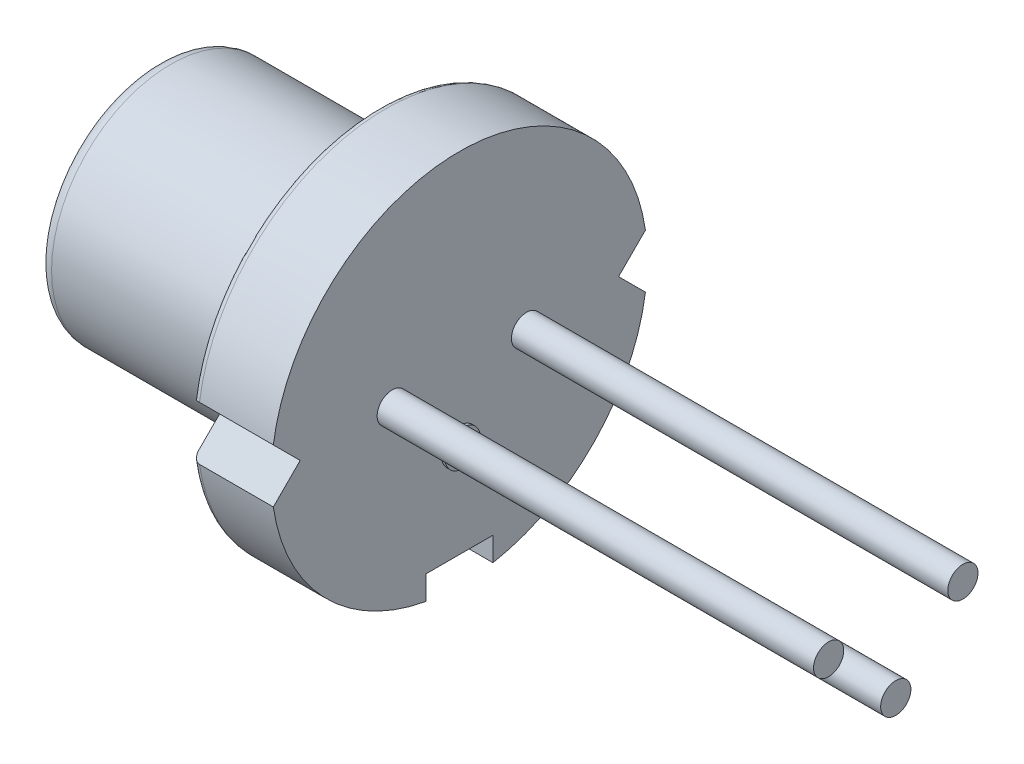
from build123d import *

# Parameters (mm, degrees)
SKETCH6_R           = 0.225
EXTRUDE2_DEPTH      = 6.5
CUT_EXTRUDE1_DEPTH  = 8.611175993
BOSS_EXTRUDE1_START = 0.25
SKETCH10_R          = 0.8
BOSS_EXTRUDE1_DEPTH = 0.25
FILLET1_R           = 0.2
FILLET2_R           = 0.1
SKETCH6_3_R         = 0.265
SKETCH6_3_R_2       = 0.225
BOSS_EXTRUDE2_DEPTH = 0.05


with BuildPart() as part:
    # Sketch4 → Revolve2 (revolve)
    with BuildSketch(Plane.XY, mode=Mode.PRIVATE) as revolve2_sk:
        with BuildLine():
            Line((0, 0), (0, 0.7))
            Line((0, 0.7), (-0.73, 0.7))
            Line((-0.73, 0.7), (-0.73, 0.8))
            Line((-0.73, 0.8), (-1.03, 0.8))
            Line((-1.03, 0.8), (-1.03, 1.775))
            Line((-1.03, 1.775), (1.72, 1.775))
            ThreePointArc((1.72, 1.775), (1.896776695, 1.848223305), (1.97, 2.025))
            Line((1.97, 2.025), (1.97, 2.05))
            Line((1.97, 2.05), (2.27, 2.05))
            Line((2.27, 2.05), (2.27, 2.8))
            Line((2.27, 2.8), (3.47, 2.8))
            Line((3.47, 2.8), (3.47, 0))
            Line((3.47, 0), (0, 0))
        make_face()
    revolve(revolve2_sk.sketch.rotate(Axis((-2.49171246, 0, 0), (1, 0, 0)), 90), axis=Axis((-2.49171246, 0, 0), (1, 0, 0)))

    # Sketch6 → Extrude2 (add)
    with BuildSketch(Plane(origin=(3.47, 0, 0), x_dir=(0, 0, -1), z_dir=(1, 0, 0))):
        with Locations(Location((0, -1, 0), (0, 0, 180))):
            Circle(SKETCH6_R)
        with Locations(Location((-1, 0, 0), (0, 0, 180))):
            Circle(SKETCH6_R)
        with Locations(Location((1, 0, 0), (0, 0, 180))):
            Circle(SKETCH6_R)
    extrude(amount=EXTRUDE2_DEPTH)

    # Sketch8 → Cut-Extrude1 (cut, through all)
    with BuildSketch(Plane(origin=(3.47, 0, 0), x_dir=(0, 0, -1), z_dir=(1, 0, 0))):
        with BuildLine():
            Line((-2.371281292, 0), (-2.771281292, 0.4))
            ThreePointArc((-2.771281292, 0.4), (-2.8, 0), (-2.771281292, -0.4))
            Line((-2.771281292, -0.4), (-2.371281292, 0))
        make_face()
        with BuildLine():
            Line((2.771281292, 0.4), (2.371281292, 0))
            Line((2.371281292, 0), (2.771281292, -0.4))
            ThreePointArc((2.771281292, -0.4), (2.792811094, -0.200514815), (2.8, 0))
            ThreePointArc((2.8, 0), (2.792811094, 0.200514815), (2.771281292, 0.4))
        make_face()
        with BuildLine():
            ThreePointArc((-0.5, -2.754995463), (0, -2.8), (0.5, -2.754995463))
            Line((0.5, -2.754995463), (0.5, -2.4))
            Line((0.5, -2.4), (-0.5, -2.4))
            Line((-0.5, -2.4), (-0.5, -2.754995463))
        make_face()
    extrude(amount=-CUT_EXTRUDE1_DEPTH, mode=Mode.SUBTRACT)

    # Sketch10 → Boss-Extrude1 (add)
    with BuildSketch(Plane.ZY.offset(0.73).offset(BOSS_EXTRUDE1_START)):
        Circle(SKETCH10_R)
    extrude(amount=-BOSS_EXTRUDE1_DEPTH)

    # Fillet1
    fillet1_edges = [part.edges().sort_by_distance(p)[0] for p in [
        (-1.03, 0, -1.775),
    ]]
    fillet(fillet1_edges, radius=FILLET1_R)

    # Fillet2
    fillet2_edges = [part.edges().sort_by_distance(p)[0] for p in [
        (2.27, 2.8, 0),
        (2.27, -1.943753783, -2.015396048),
        (2.27, -1.943753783, 2.015396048),
    ]]
    fillet(fillet2_edges, radius=FILLET2_R)

    # Sketch6_3 → Boss-Extrude2 (add)
    with BuildSketch(Plane(origin=(3.47, 0, 0), x_dir=(0, 0, -1), z_dir=(1, 0, 0))):
        with Locations(Location((0, -1, 0), (0, 0, 180))):
            Circle(SKETCH6_3_R)
        with Locations((0, -1)):
            Circle(SKETCH6_3_R_2, mode=Mode.SUBTRACT)
    extrude(amount=BOSS_EXTRUDE2_DEPTH)


solid = part.part
